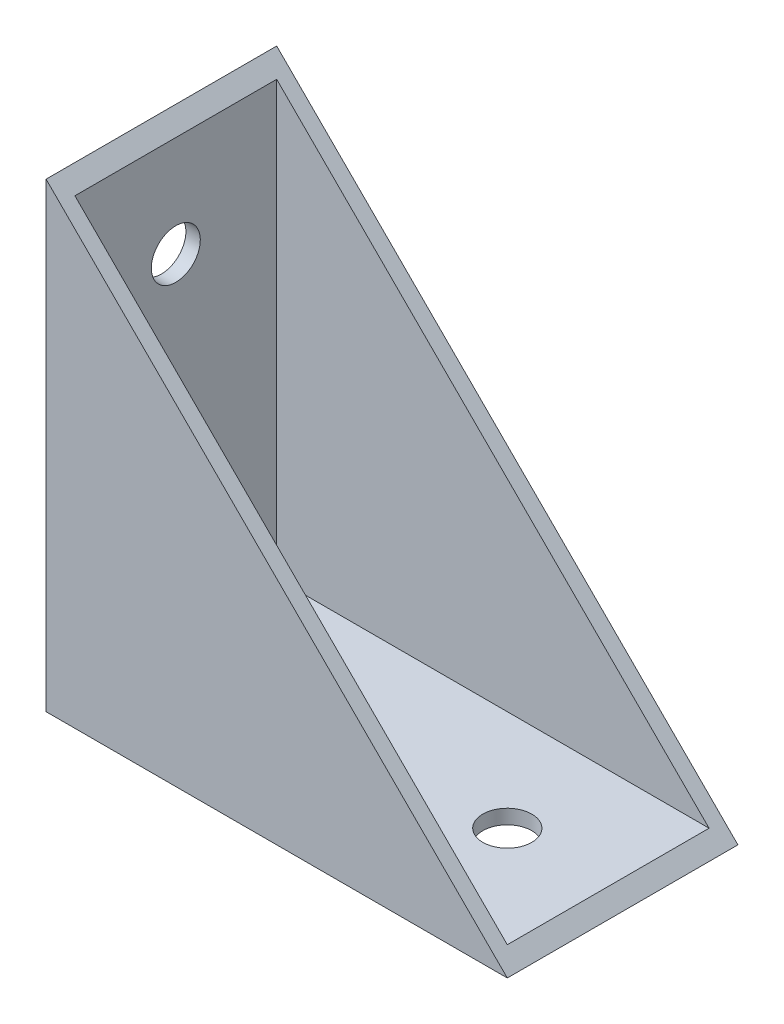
ISO-10303-21;
HEADER;
FILE_DESCRIPTION(('STEP AP214'),'2;1');
FILE_NAME('part.step','',(''),(''),'','','');
FILE_SCHEMA(('AUTOMOTIVE_DESIGN { 1 0 10303 214 1 1 1 1 }'));
ENDSEC;
DATA;
#1=APPLICATION_CONTEXT('core data for automotive mechanical design processes');
#2=APPLICATION_PROTOCOL_DEFINITION('international standard','automotive_design',2000,#1);
#3=PRODUCT_CONTEXT('',#1,'mechanical');
#4=PRODUCT('Part','Part','',(#3));
#5=PRODUCT_RELATED_PRODUCT_CATEGORY('part','',(#4));
#6=PRODUCT_DEFINITION_FORMATION('','',#4);
#7=PRODUCT_DEFINITION_CONTEXT('part definition',#1,'design');
#8=PRODUCT_DEFINITION('design','',#6,#7);
#9=PRODUCT_DEFINITION_SHAPE('','',#8);
#10=(LENGTH_UNIT() NAMED_UNIT(*) SI_UNIT(.MILLI.,.METRE.));
#11=(NAMED_UNIT(*) PLANE_ANGLE_UNIT() SI_UNIT($,.RADIAN.));
#12=(NAMED_UNIT(*) SI_UNIT($,.STERADIAN.) SOLID_ANGLE_UNIT());
#13=UNCERTAINTY_MEASURE_WITH_UNIT(LENGTH_MEASURE(1.E-05),#10,'distance_accuracy_value','');
#14=(GEOMETRIC_REPRESENTATION_CONTEXT(3) GLOBAL_UNCERTAINTY_ASSIGNED_CONTEXT((#13)) GLOBAL_UNIT_ASSIGNED_CONTEXT((#10,
#11,#12)) REPRESENTATION_CONTEXT('',''));
#15=CARTESIAN_POINT('',(0.,0.,0.));
#16=DIRECTION('',(0.,0.,1.));
#17=DIRECTION('',(1.,0.,0.));
#18=AXIS2_PLACEMENT_3D('',#15,#16,#17);
#19=CARTESIAN_POINT('',(80.,60.,0.));
#20=DIRECTION('',(-1.,0.,0.));
#21=DIRECTION('',(0.,-1.,0.));
#22=AXIS2_PLACEMENT_3D('',#19,#20,#21);
#23=CYLINDRICAL_SURFACE('',#22,4.25);
#24=CARTESIAN_POINT('',(2.49999999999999,60.,0.));
#25=DIRECTION('',(-1.,0.,0.));
#26=DIRECTION('',(0.,-1.,0.));
#27=AXIS2_PLACEMENT_3D('',#24,#25,#26);
#28=CIRCLE('',#27,4.25);
#29=CARTESIAN_POINT('',(2.49999999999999,55.75,0.));
#30=VERTEX_POINT('',#29);
#31=EDGE_CURVE('E19',#30,#30,#28,.T.);
#32=ORIENTED_EDGE('',*,*,#31,.F.);
#33=EDGE_LOOP('',(#32));
#34=FACE_BOUND('',#33,.T.);
#35=CARTESIAN_POINT('',(0.,60.,0.));
#36=DIRECTION('',(-1.,0.,0.));
#37=DIRECTION('',(0.,-1.,0.));
#38=AXIS2_PLACEMENT_3D('',#35,#36,#37);
#39=CIRCLE('',#38,4.25);
#40=CARTESIAN_POINT('',(0.,55.75,0.));
#41=VERTEX_POINT('',#40);
#42=EDGE_CURVE('E111',#41,#41,#39,.T.);
#43=ORIENTED_EDGE('',*,*,#42,.T.);
#44=EDGE_LOOP('',(#43));
#45=FACE_BOUND('',#44,.T.);
#46=ADVANCED_FACE('F16',(#34,#45),#23,.F.);
#47=CARTESIAN_POINT('',(80.,20.,0.));
#48=DIRECTION('',(-1.,0.,0.));
#49=DIRECTION('',(0.,-1.,0.));
#50=AXIS2_PLACEMENT_3D('',#47,#48,#49);
#51=CYLINDRICAL_SURFACE('',#50,4.25);
#52=CARTESIAN_POINT('',(2.49999999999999,20.,0.));
#53=DIRECTION('',(-1.,0.,0.));
#54=DIRECTION('',(0.,-1.,0.));
#55=AXIS2_PLACEMENT_3D('',#52,#53,#54);
#56=CIRCLE('',#55,4.25);
#57=CARTESIAN_POINT('',(2.49999999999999,15.75,0.));
#58=VERTEX_POINT('',#57);
#59=EDGE_CURVE('E92',#58,#58,#56,.T.);
#60=ORIENTED_EDGE('',*,*,#59,.F.);
#61=EDGE_LOOP('',(#60));
#62=FACE_BOUND('',#61,.T.);
#63=CARTESIAN_POINT('',(0.,20.,0.));
#64=DIRECTION('',(-1.,0.,0.));
#65=DIRECTION('',(0.,-1.,0.));
#66=AXIS2_PLACEMENT_3D('',#63,#64,#65);
#67=CIRCLE('',#66,4.25);
#68=CARTESIAN_POINT('',(0.,15.75,0.));
#69=VERTEX_POINT('',#68);
#70=EDGE_CURVE('E108',#69,#69,#67,.T.);
#71=ORIENTED_EDGE('',*,*,#70,.T.);
#72=EDGE_LOOP('',(#71));
#73=FACE_BOUND('',#72,.T.);
#74=ADVANCED_FACE('F125',(#62,#73),#51,.F.);
#75=CARTESIAN_POINT('',(60.,80.,0.));
#76=DIRECTION('',(0.,-1.,0.));
#77=DIRECTION('',(0.,0.,-1.));
#78=AXIS2_PLACEMENT_3D('',#75,#76,#77);
#79=CYLINDRICAL_SURFACE('',#78,4.25);
#80=CARTESIAN_POINT('',(60.,2.5,0.));
#81=DIRECTION('',(0.,-1.,0.));
#82=DIRECTION('',(0.,0.,-1.));
#83=AXIS2_PLACEMENT_3D('',#80,#81,#82);
#84=CIRCLE('',#83,4.25);
#85=CARTESIAN_POINT('',(60.,2.5,-4.25));
#86=VERTEX_POINT('',#85);
#87=EDGE_CURVE('E91',#86,#86,#84,.T.);
#88=ORIENTED_EDGE('',*,*,#87,.F.);
#89=EDGE_LOOP('',(#88));
#90=FACE_BOUND('',#89,.T.);
#91=CARTESIAN_POINT('',(60.,0.,0.));
#92=DIRECTION('',(0.,-1.,0.));
#93=DIRECTION('',(0.,0.,-1.));
#94=AXIS2_PLACEMENT_3D('',#91,#92,#93);
#95=CIRCLE('',#94,4.25);
#96=CARTESIAN_POINT('',(60.,0.,-4.25));
#97=VERTEX_POINT('',#96);
#98=EDGE_CURVE('E104',#97,#97,#95,.T.);
#99=ORIENTED_EDGE('',*,*,#98,.T.);
#100=EDGE_LOOP('',(#99));
#101=FACE_BOUND('',#100,.T.);
#102=ADVANCED_FACE('F187',(#90,#101),#79,.F.);
#103=CARTESIAN_POINT('',(20.,80.,0.));
#104=DIRECTION('',(0.,-1.,0.));
#105=DIRECTION('',(0.,0.,-1.));
#106=AXIS2_PLACEMENT_3D('',#103,#104,#105);
#107=CYLINDRICAL_SURFACE('',#106,4.25);
#108=CARTESIAN_POINT('',(20.,2.5,0.));
#109=DIRECTION('',(0.,-1.,0.));
#110=DIRECTION('',(0.,0.,-1.));
#111=AXIS2_PLACEMENT_3D('',#108,#109,#110);
#112=CIRCLE('',#111,4.25);
#113=CARTESIAN_POINT('',(20.,2.5,-4.25));
#114=VERTEX_POINT('',#113);
#115=EDGE_CURVE('E81',#114,#114,#112,.T.);
#116=ORIENTED_EDGE('',*,*,#115,.F.);
#117=EDGE_LOOP('',(#116));
#118=FACE_BOUND('',#117,.T.);
#119=CARTESIAN_POINT('',(20.,0.,0.));
#120=DIRECTION('',(0.,-1.,0.));
#121=DIRECTION('',(0.,0.,-1.));
#122=AXIS2_PLACEMENT_3D('',#119,#120,#121);
#123=CIRCLE('',#122,4.25);
#124=CARTESIAN_POINT('',(20.,0.,-4.25));
#125=VERTEX_POINT('',#124);
#126=EDGE_CURVE('E100',#125,#125,#123,.T.);
#127=ORIENTED_EDGE('',*,*,#126,.T.);
#128=EDGE_LOOP('',(#127));
#129=FACE_BOUND('',#128,.T.);
#130=ADVANCED_FACE('F189',(#118,#129),#107,.F.);
#131=CARTESIAN_POINT('',(0.,80.,20.));
#132=DIRECTION('',(0.,0.,1.));
#133=DIRECTION('',(1.,0.,0.));
#134=AXIS2_PLACEMENT_3D('',#131,#132,#133);
#135=PLANE('',#134);
#136=DIRECTION('',(0.,1.,0.));
#137=VECTOR('',#136,1.);
#138=CARTESIAN_POINT('',(0.,80.,20.));
#139=LINE('',#138,#137);
#140=CARTESIAN_POINT('',(0.,80.,20.));
#141=VERTEX_POINT('',#140);
#142=CARTESIAN_POINT('',(0.,0.,20.));
#143=VERTEX_POINT('',#142);
#144=EDGE_CURVE('E107',#141,#143,#139,.F.);
#145=ORIENTED_EDGE('',*,*,#144,.T.);
#146=DIRECTION('',(1.,0.,0.));
#147=VECTOR('',#146,1.);
#148=CARTESIAN_POINT('',(0.,0.,20.));
#149=LINE('',#148,#147);
#150=CARTESIAN_POINT('',(80.,0.,20.));
#151=VERTEX_POINT('',#150);
#152=EDGE_CURVE('E175',#143,#151,#149,.T.);
#153=ORIENTED_EDGE('',*,*,#152,.T.);
#154=DIRECTION('',(0.707106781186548,-0.707106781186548,0.));
#155=VECTOR('',#154,1.);
#156=CARTESIAN_POINT('',(80.,0.,20.));
#157=LINE('',#156,#155);
#158=EDGE_CURVE('E171',#151,#141,#157,.F.);
#159=ORIENTED_EDGE('',*,*,#158,.T.);
#160=EDGE_LOOP('',(#145,#153,#159));
#161=FACE_BOUND('',#160,.T.);
#162=ADVANCED_FACE('F180',(#161),#135,.T.);
#163=CARTESIAN_POINT('',(2.5,80.,20.));
#164=DIRECTION('',(1.,0.,0.));
#165=DIRECTION('',(0.,1.,0.));
#166=AXIS2_PLACEMENT_3D('',#163,#164,#165);
#167=PLANE('',#166);
#168=DIRECTION('',(0.,1.,0.));
#169=VECTOR('',#168,1.);
#170=CARTESIAN_POINT('',(2.5,80.,17.5));
#171=LINE('',#170,#169);
#172=CARTESIAN_POINT('',(2.49999999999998,77.5,17.5));
#173=VERTEX_POINT('',#172);
#174=CARTESIAN_POINT('',(2.5,2.5,17.5));
#175=VERTEX_POINT('',#174);
#176=EDGE_CURVE('E84',#173,#175,#171,.F.);
#177=ORIENTED_EDGE('',*,*,#176,.T.);
#178=DIRECTION('',(0.,0.,1.));
#179=VECTOR('',#178,1.);
#180=CARTESIAN_POINT('',(2.5,2.5,20.));
#181=LINE('',#180,#179);
#182=CARTESIAN_POINT('',(2.5,2.5,-17.5));
#183=VERTEX_POINT('',#182);
#184=EDGE_CURVE('E71',#183,#175,#181,.T.);
#185=ORIENTED_EDGE('',*,*,#184,.F.);
#186=DIRECTION('',(0.,1.,0.));
#187=VECTOR('',#186,1.);
#188=CARTESIAN_POINT('',(2.5,80.,-17.5));
#189=LINE('',#188,#187);
#190=CARTESIAN_POINT('',(2.49999999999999,77.5,-17.5));
#191=VERTEX_POINT('',#190);
#192=EDGE_CURVE('E66',#191,#183,#189,.F.);
#193=ORIENTED_EDGE('',*,*,#192,.F.);
#194=DIRECTION('',(0.,0.,1.));
#195=VECTOR('',#194,1.);
#196=CARTESIAN_POINT('',(2.49999999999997,77.5,20.));
#197=LINE('',#196,#195);
#198=EDGE_CURVE('E87',#191,#173,#197,.T.);
#199=ORIENTED_EDGE('',*,*,#198,.T.);
#200=EDGE_LOOP('',(#177,#185,#193,#199));
#201=FACE_BOUND('',#200,.T.);
#202=ORIENTED_EDGE('',*,*,#59,.T.);
#203=EDGE_LOOP('',(#202));
#204=FACE_BOUND('',#203,.T.);
#205=ORIENTED_EDGE('',*,*,#31,.T.);
#206=EDGE_LOOP('',(#205));
#207=FACE_BOUND('',#206,.T.);
#208=ADVANCED_FACE('F85',(#201,#204,#207),#167,.T.);
#209=CARTESIAN_POINT('',(0.,80.,17.5));
#210=DIRECTION('',(0.,0.,1.));
#211=DIRECTION('',(1.,0.,0.));
#212=AXIS2_PLACEMENT_3D('',#209,#210,#211);
#213=PLANE('',#212);
#214=DIRECTION('',(1.,0.,0.));
#215=VECTOR('',#214,1.);
#216=CARTESIAN_POINT('',(0.,2.5,17.5));
#217=LINE('',#216,#215);
#218=CARTESIAN_POINT('',(77.5,2.5,17.5));
#219=VERTEX_POINT('',#218);
#220=EDGE_CURVE('E77',#175,#219,#217,.T.);
#221=ORIENTED_EDGE('',*,*,#220,.F.);
#222=ORIENTED_EDGE('',*,*,#176,.F.);
#223=DIRECTION('',(0.707106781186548,-0.707106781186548,0.));
#224=VECTOR('',#223,1.);
#225=CARTESIAN_POINT('',(80.,0.,17.5));
#226=LINE('',#225,#224);
#227=EDGE_CURVE('E95',#173,#219,#226,.T.);
#228=ORIENTED_EDGE('',*,*,#227,.T.);
#229=EDGE_LOOP('',(#221,#222,#228));
#230=FACE_BOUND('',#229,.T.);
#231=ADVANCED_FACE('F94',(#230),#213,.F.);
#232=CARTESIAN_POINT('',(0.,2.5,20.));
#233=DIRECTION('',(0.,1.,0.));
#234=DIRECTION('',(0.,0.,1.));
#235=AXIS2_PLACEMENT_3D('',#232,#233,#234);
#236=PLANE('',#235);
#237=ORIENTED_EDGE('',*,*,#220,.T.);
#238=DIRECTION('',(0.,0.,1.));
#239=VECTOR('',#238,1.);
#240=CARTESIAN_POINT('',(77.5,2.5,20.));
#241=LINE('',#240,#239);
#242=CARTESIAN_POINT('',(77.5,2.5,-17.5));
#243=VERTEX_POINT('',#242);
#244=EDGE_CURVE('E164',#219,#243,#241,.F.);
#245=ORIENTED_EDGE('',*,*,#244,.T.);
#246=DIRECTION('',(1.,0.,0.));
#247=VECTOR('',#246,1.);
#248=CARTESIAN_POINT('',(0.,2.5,-17.5));
#249=LINE('',#248,#247);
#250=EDGE_CURVE('E79',#183,#243,#249,.T.);
#251=ORIENTED_EDGE('',*,*,#250,.F.);
#252=ORIENTED_EDGE('',*,*,#184,.T.);
#253=EDGE_LOOP('',(#237,#245,#251,#252));
#254=FACE_BOUND('',#253,.T.);
#255=ORIENTED_EDGE('',*,*,#115,.T.);
#256=EDGE_LOOP('',(#255));
#257=FACE_BOUND('',#256,.T.);
#258=ORIENTED_EDGE('',*,*,#87,.T.);
#259=EDGE_LOOP('',(#258));
#260=FACE_BOUND('',#259,.T.);
#261=ADVANCED_FACE('F73',(#254,#257,#260),#236,.T.);
#262=CARTESIAN_POINT('',(0.,80.,-17.5));
#263=DIRECTION('',(0.,0.,1.));
#264=DIRECTION('',(1.,0.,0.));
#265=AXIS2_PLACEMENT_3D('',#262,#263,#264);
#266=PLANE('',#265);
#267=ORIENTED_EDGE('',*,*,#192,.T.);
#268=ORIENTED_EDGE('',*,*,#250,.T.);
#269=DIRECTION('',(0.707106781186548,-0.707106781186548,0.));
#270=VECTOR('',#269,1.);
#271=CARTESIAN_POINT('',(80.,0.,-17.5));
#272=LINE('',#271,#270);
#273=EDGE_CURVE('E162',#243,#191,#272,.F.);
#274=ORIENTED_EDGE('',*,*,#273,.T.);
#275=EDGE_LOOP('',(#267,#268,#274));
#276=FACE_BOUND('',#275,.T.);
#277=ADVANCED_FACE('F131',(#276),#266,.T.);
#278=CARTESIAN_POINT('',(0.,80.,20.));
#279=DIRECTION('',(1.,0.,0.));
#280=DIRECTION('',(0.,1.,0.));
#281=AXIS2_PLACEMENT_3D('',#278,#279,#280);
#282=PLANE('',#281);
#283=DIRECTION('',(0.,0.,1.));
#284=VECTOR('',#283,1.);
#285=CARTESIAN_POINT('',(0.,0.,20.));
#286=LINE('',#285,#284);
#287=CARTESIAN_POINT('',(0.,0.,-20.));
#288=VERTEX_POINT('',#287);
#289=EDGE_CURVE('E103',#288,#143,#286,.T.);
#290=ORIENTED_EDGE('',*,*,#289,.T.);
#291=ORIENTED_EDGE('',*,*,#144,.F.);
#292=DIRECTION('',(0.,0.,1.));
#293=VECTOR('',#292,1.);
#294=CARTESIAN_POINT('',(0.,80.,20.));
#295=LINE('',#294,#293);
#296=CARTESIAN_POINT('',(0.,80.,-20.));
#297=VERTEX_POINT('',#296);
#298=EDGE_CURVE('E161',#141,#297,#295,.F.);
#299=ORIENTED_EDGE('',*,*,#298,.T.);
#300=DIRECTION('',(0.,1.,0.));
#301=VECTOR('',#300,1.);
#302=CARTESIAN_POINT('',(0.,80.,-20.));
#303=LINE('',#302,#301);
#304=EDGE_CURVE('E157',#297,#288,#303,.F.);
#305=ORIENTED_EDGE('',*,*,#304,.T.);
#306=EDGE_LOOP('',(#290,#291,#299,#305));
#307=FACE_BOUND('',#306,.T.);
#308=ORIENTED_EDGE('',*,*,#70,.F.);
#309=EDGE_LOOP('',(#308));
#310=FACE_BOUND('',#309,.T.);
#311=ORIENTED_EDGE('',*,*,#42,.F.);
#312=EDGE_LOOP('',(#311));
#313=FACE_BOUND('',#312,.T.);
#314=ADVANCED_FACE('F128',(#307,#310,#313),#282,.F.);
#315=CARTESIAN_POINT('',(0.,0.,20.));
#316=DIRECTION('',(0.,1.,0.));
#317=DIRECTION('',(0.,0.,1.));
#318=AXIS2_PLACEMENT_3D('',#315,#316,#317);
#319=PLANE('',#318);
#320=DIRECTION('',(0.,0.,1.));
#321=VECTOR('',#320,1.);
#322=CARTESIAN_POINT('',(80.,0.,20.));
#323=LINE('',#322,#321);
#324=CARTESIAN_POINT('',(80.,0.,-20.));
#325=VERTEX_POINT('',#324);
#326=EDGE_CURVE('E33',#325,#151,#323,.T.);
#327=ORIENTED_EDGE('',*,*,#326,.T.);
#328=ORIENTED_EDGE('',*,*,#152,.F.);
#329=ORIENTED_EDGE('',*,*,#289,.F.);
#330=DIRECTION('',(1.,0.,0.));
#331=VECTOR('',#330,1.);
#332=CARTESIAN_POINT('',(0.,0.,-20.));
#333=LINE('',#332,#331);
#334=EDGE_CURVE('E25',#288,#325,#333,.T.);
#335=ORIENTED_EDGE('',*,*,#334,.T.);
#336=EDGE_LOOP('',(#327,#328,#329,#335));
#337=FACE_BOUND('',#336,.T.);
#338=ORIENTED_EDGE('',*,*,#126,.F.);
#339=EDGE_LOOP('',(#338));
#340=FACE_BOUND('',#339,.T.);
#341=ORIENTED_EDGE('',*,*,#98,.F.);
#342=EDGE_LOOP('',(#341));
#343=FACE_BOUND('',#342,.T.);
#344=ADVANCED_FACE('F130',(#337,#340,#343),#319,.F.);
#345=CARTESIAN_POINT('',(80.,0.,20.));
#346=DIRECTION('',(-0.707106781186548,-0.707106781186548,0.));
#347=DIRECTION('',(0.707106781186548,-0.707106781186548,0.));
#348=AXIS2_PLACEMENT_3D('',#345,#346,#347);
#349=PLANE('',#348);
#350=ORIENTED_EDGE('',*,*,#244,.F.);
#351=ORIENTED_EDGE('',*,*,#227,.F.);
#352=ORIENTED_EDGE('',*,*,#198,.F.);
#353=ORIENTED_EDGE('',*,*,#273,.F.);
#354=EDGE_LOOP('',(#350,#351,#352,#353));
#355=FACE_BOUND('',#354,.T.);
#356=ORIENTED_EDGE('',*,*,#298,.F.);
#357=ORIENTED_EDGE('',*,*,#158,.F.);
#358=ORIENTED_EDGE('',*,*,#326,.F.);
#359=DIRECTION('',(-0.707106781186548,0.707106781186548,0.));
#360=VECTOR('',#359,1.);
#361=CARTESIAN_POINT('',(80.,0.,-20.));
#362=LINE('',#361,#360);
#363=EDGE_CURVE('E11',#325,#297,#362,.T.);
#364=ORIENTED_EDGE('',*,*,#363,.T.);
#365=EDGE_LOOP('',(#356,#357,#358,#364));
#366=FACE_BOUND('',#365,.T.);
#367=ADVANCED_FACE('F139',(#355,#366),#349,.F.);
#368=CARTESIAN_POINT('',(0.,80.,-20.));
#369=DIRECTION('',(0.,0.,1.));
#370=DIRECTION('',(1.,0.,0.));
#371=AXIS2_PLACEMENT_3D('',#368,#369,#370);
#372=PLANE('',#371);
#373=ORIENTED_EDGE('',*,*,#334,.F.);
#374=ORIENTED_EDGE('',*,*,#304,.F.);
#375=ORIENTED_EDGE('',*,*,#363,.F.);
#376=EDGE_LOOP('',(#373,#374,#375));
#377=FACE_BOUND('',#376,.T.);
#378=ADVANCED_FACE('F145',(#377),#372,.F.);
#379=CLOSED_SHELL('',(#46,#74,#102,#130,#162,#208,#231,#261,#277,#314,#344,#367,#378));
#380=MANIFOLD_SOLID_BREP('B1',#379);
#381=ADVANCED_BREP_SHAPE_REPRESENTATION('',(#18,#380),#14);
#382=SHAPE_DEFINITION_REPRESENTATION(#9,#381);
ENDSEC;
END-ISO-10303-21;
